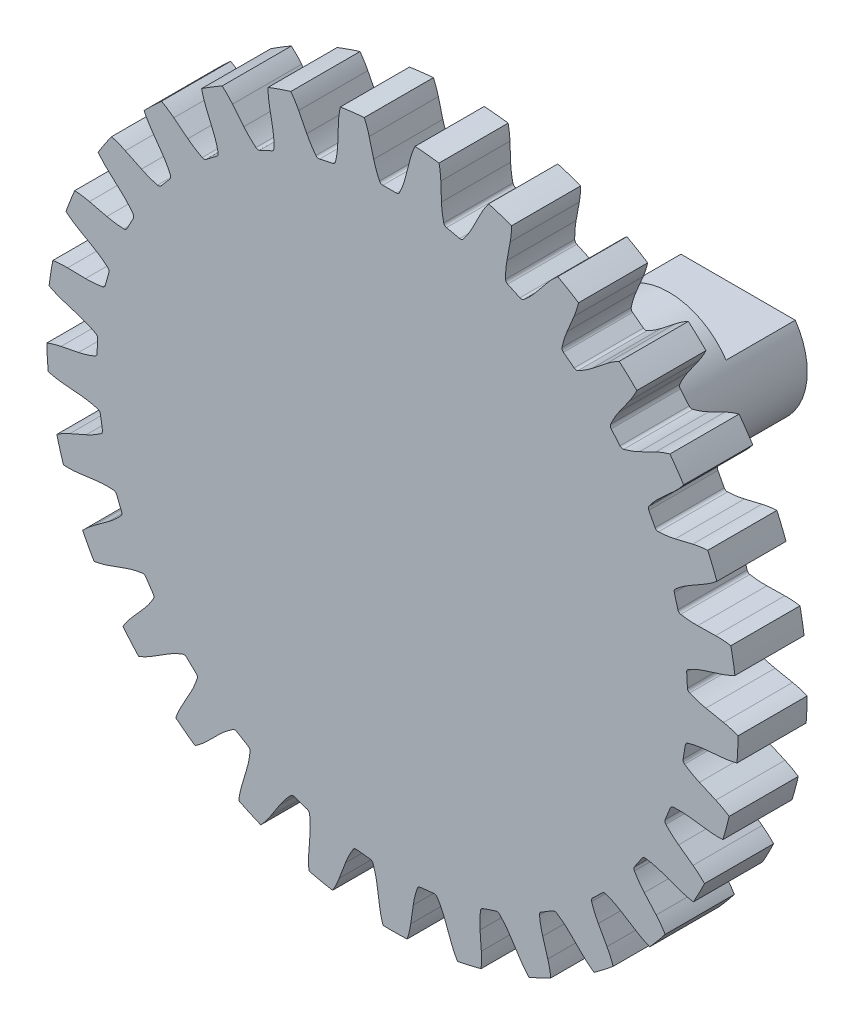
from build123d import *

# Parameters (mm, degrees)
SKETCH1_R          = 63.5
EXTRUDE1_DEPTH     = 12.7
SKETCH3_R          = 12.7
EXTRUDE2_DEPTH     = 50.8
CUT_EXTRUDE2_DEPTH = 122.121019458
CIRPATTERN3_COUNT  = 29
CUT_EXTRUDE3_START = -12.7
CUT_EXTRUDE3_DEPTH = 12.7


with BuildPart() as part:
    # Sketch1 → Extrude1 (new body)
    with BuildSketch(Plane.XY):
        Circle(SKETCH1_R)
    extrude(amount=EXTRUDE1_DEPTH)

    # Sketch3 → Extrude2 (add)
    with BuildSketch(Plane(origin=(0, 0, 0), x_dir=(-1, 0, 0), z_dir=(0, 0, -1))):
        with Locations(Location((0, 0, 0), (0, 0, 180))):
            Circle(SKETCH3_R)
    extrude(amount=EXTRUDE2_DEPTH)

    # Sketch4 → Cut-Extrude2 (cut, through all)
    with BuildSketch(Plane(origin=(-0.53626367, -17.354241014, 12.7), x_dir=(1, 0, 0), z_dir=(0, 0, 1))):
        with BuildLine():
            Line((-129.068430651, 352.093803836), (-4.656553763, 80.717984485))
            ThreePointArc((-4.656553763, 80.717984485), (-4.128869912, 79.418245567), (-3.717983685, 78.076998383))
            Line((-3.717983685, 78.076998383), (-2.894365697, 74.892303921))
            ThreePointArc((-2.894365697, 74.892303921), (-2.42922611, 73.400796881), (-1.819728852, 71.96223469))
            ThreePointArc((-1.819728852, 71.96223469), (-1.574529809, 71.688347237), (-1.221257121, 71.586684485))
            Line((-1.221257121, 71.586684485), (1.25861219, 71.586684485))
            ThreePointArc((1.25861219, 71.586684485), (1.611884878, 71.688347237), (1.85708392, 71.96223469))
            ThreePointArc((1.85708392, 71.96223469), (2.466581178, 73.400796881), (2.931720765, 74.892303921))
            Line((2.931720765, 74.892303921), (3.755338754, 78.076998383))
            ThreePointArc((3.755338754, 78.076998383), (4.16622498, 79.418245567), (4.693908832, 80.717984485))
            Line((4.693908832, 80.717984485), (129.10578572, 352.093803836))
            Line((129.10578572, 352.093803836), (129.10578572, 949.163817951))
            Line((129.10578572, 949.163817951), (-129.068430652, 949.163817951))
            Line((-129.068430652, 949.163817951), (-129.068430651, 352.093803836))
        make_face()
    cut_extrude2 = extrude(amount=-CUT_EXTRUDE2_DEPTH, mode=Mode.SUBTRACT)

    # CirPattern3: Cut-Extrude2 ×29 about axis
    cirpattern3_axis = Axis((0, 0, 0), (0, 0, 1))
    for i in range(1, CIRPATTERN3_COUNT):
        add(cut_extrude2.rotate(cirpattern3_axis, i * 360 / CIRPATTERN3_COUNT), mode=Mode.SUBTRACT)

    # Sketch5 → Cut-Extrude3 (cut)
    with BuildSketch(Plane(origin=(0, 0, -50.8), x_dir=(-1, 0, 0), z_dir=(0, 0, -1)).offset(CUT_EXTRUDE3_START)):
        with BuildLine():
            Line((-10.501895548, 7.141441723), (10.501895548, 7.141441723))
            ThreePointArc((10.501895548, 7.141441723), (0, 12.7), (-10.501895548, 7.141441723))
        make_face()
    extrude(amount=CUT_EXTRUDE3_DEPTH, mode=Mode.SUBTRACT)


solid = part.part
